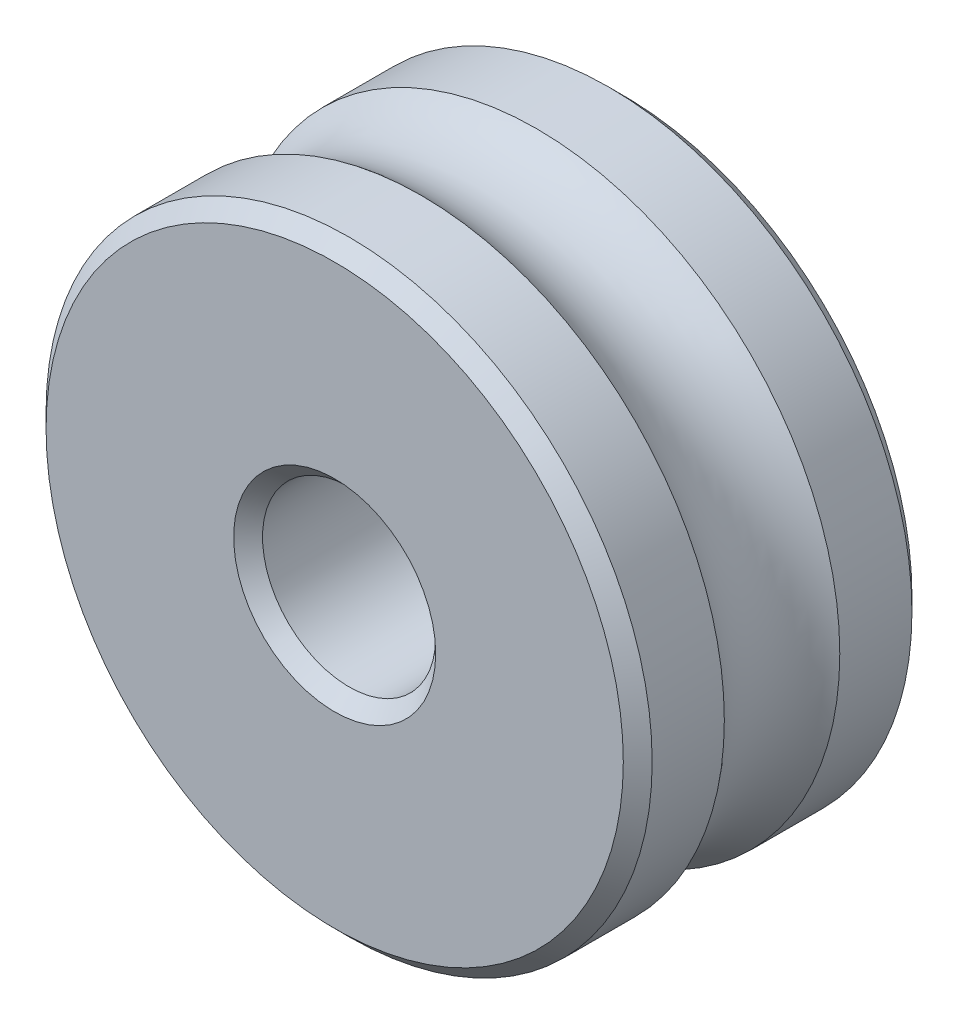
from build123d import *

# Parameters (mm, degrees)
SKETCH1_R           = 21
SKETCH1_R_2         = 6
BOSS_EXTRUDE1_DEPTH = 10
CHAMFER1_SIZE       = 1


with BuildPart() as part:
    # Sketch1 → Boss-Extrude1 (new, symmetric)
    with BuildSketch(Plane.XY):
        Circle(SKETCH1_R)
        Circle(SKETCH1_R_2, mode=Mode.SUBTRACT)
    extrude(amount=BOSS_EXTRUDE1_DEPTH, both=True)

    # Sketch4 → Cut-Revolve1 (revolve, cut)
    with BuildSketch(Plane(origin=(0, 0, 0), x_dir=(0, 0, -1), z_dir=(1, 0, 0)), mode=Mode.PRIVATE) as cut_revolve1_sk:
        with BuildLine():
            Line((4, 21), (-4, 21))
            ThreePointArc((-4, 21), (0, 19.472135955), (4, 21))
        make_face()
    revolve(cut_revolve1_sk.sketch.rotate(Axis((0, 0, 0), (0, 0, -1)), 180), axis=Axis((0, 0, 0), (0, 0, -1)), mode=Mode.SUBTRACT)

    # Chamfer1
    chamfer1_edges = [part.edges().sort_by_distance(p)[0] for p in [
        (-21, 0, -10),
        (-21, 0, 10),
        (-6, 0, -10),
        (-6, 0, 10),
    ]]
    chamfer(chamfer1_edges, length=CHAMFER1_SIZE)


solid = part.part
